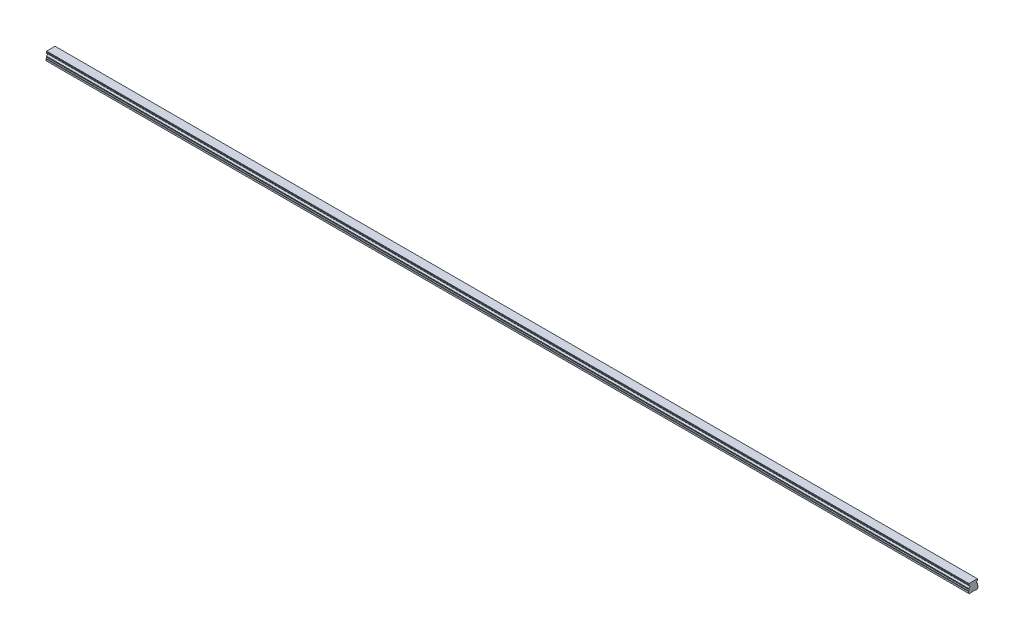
from build123d import *

# Parameters (mm, degrees)
BOSS_EXTRUDE1_DEPTH        = 1440
SKETCH3_R                  = 2.5
SKETCH3_R_2                = 2.1
CUT_EXTRUDE3_DEPTH         = 7
SKETCH3_2_R                = 2.1
CUT_EXTRUDE4_DEPTH         = 9.5
CHAMFER1_SIZE              = 0.4
LPATTERN2_COUNT            = 24
LPATTERN2_PITCH            = 60
CHAMFER1_OF_LPATTERN2_SIZE = 0.4


with BuildPart() as part:
    # Sketch1 → Boss-Extrude1 (new body)
    with BuildSketch(Plane(origin=(0, 0, 0), x_dir=(0, 0, -1), z_dir=(1, 0, 0))):
        with BuildLine():
            Line((6.59, 14), (-6.59, 14))
            Line((-6.59, 14), (-6.59, 13.15))
            Line((-6.59, 13.15), (-6.96, 12.356532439))
            Line((-6.96, 12.356532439), (-6.96, 11.435174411))
            ThreePointArc((-6.96, 11.435174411), (-5.25, 9.5), (-6.96, 7.564825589))
            Line((-6.96, 7.564825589), (-6.96, 6.643467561))
            Line((-6.96, 6.643467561), (-6.59, 5.85))
            Line((-6.59, 5.85), (-7.032116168, 4.2))
            Line((-7.032116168, 4.2), (-7.5, 3.929867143))
            Line((-7.5, 3.929867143), (-7.5, 1.4))
            Line((-7.5, 1.4), (-6.1, 0))
            Line((-6.1, 0), (-3.65, 0))
            Line((-3.65, 0), (-3.25, 0.4))
            Line((-3.25, 0.4), (3.25, 0.4))
            Line((3.25, 0.4), (3.65, 0))
            Line((3.65, 0), (6.1, 0))
            Line((6.1, 0), (7.5, 1.4))
            Line((7.5, 1.4), (7.5, 3.929867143))
            Line((7.5, 3.929867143), (7.032116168, 4.2))
            Line((7.032116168, 4.2), (6.59, 5.85))
            Line((6.59, 5.85), (6.96, 6.643467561))
            Line((6.96, 6.643467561), (6.96, 7.564825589))
            ThreePointArc((6.96, 7.564825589), (5.25, 9.5), (6.96, 11.435174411))
            Line((6.96, 11.435174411), (6.96, 12.356532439))
            Line((6.96, 12.356532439), (6.59, 13.15))
            Line((6.59, 13.15), (6.59, 14))
        make_face()
    extrude(amount=BOSS_EXTRUDE1_DEPTH)

    # Sketch3 → Cut-Extrude3 (cut)
    with BuildSketch(Plane.XZ):
        with Locations(Location((30, 0, 0), (0, 0, 270))):
            Circle(SKETCH3_R)
        with Locations(Location((30, 0, 0), (0, 0, 270))):
            Circle(SKETCH3_R_2, mode=Mode.SUBTRACT)
    cut_extrude3 = extrude(amount=-CUT_EXTRUDE3_DEPTH, mode=Mode.SUBTRACT)

    # Sketch3_2 → Cut-Extrude4 (cut)
    with BuildSketch(Plane.XZ):
        with Locations(Location((30, 0, 0), (0, 0, 270))):
            Circle(SKETCH3_2_R)
    cut_extrude4 = extrude(amount=-CUT_EXTRUDE4_DEPTH, mode=Mode.SUBTRACT)

    # Cut-Extrude5 cone 1 section (on through the dimple's axis) → Cut-Extrude5 (revolve, cut)
    with BuildSketch(Plane(origin=(30, 9.5, 0), x_dir=(0, 0, -1), z_dir=(1, 0, 0))):
        Polygon((0, 0), (2.1, 0), (0, 1.212435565), align=None)
    revolve(axis=Axis((30, 9.5, 0), (0, 1, 0)), mode=Mode.SUBTRACT)

    # Chamfer1
    chamfer1_edges = [part.edges().sort_by_distance(p)[0] for p in [
        (30, 0.4, 2.5),
    ]]
    chamfer(chamfer1_edges, length=CHAMFER1_SIZE)

    # LPattern2: Cut-Extrude3, Cut-Extrude4 ×24
    with Locations(*[(i * LPATTERN2_PITCH, 0, 0) for i in range(1, LPATTERN2_COUNT)]):
        add(cut_extrude3, mode=Mode.SUBTRACT)
        add(cut_extrude4, mode=Mode.SUBTRACT)

    # Chamfer1 of LPattern2
    chamfer1_of_lpattern2_edges = [part.edges().sort_by_distance(p)[0] for p in [
        (90, 0.4, 2.5),
        (150, 0.4, 2.5),
        (210, 0.4, 2.5),
        (270, 0.4, 2.5),
        (330, 0.4, 2.5),
        (390, 0.4, 2.5),
        (450, 0.4, 2.5),
        (510, 0.4, 2.5),
        (570, 0.4, 2.5),
        (630, 0.4, 2.5),
        (690, 0.4, 2.5),
        (750, 0.4, 2.5),
        (810, 0.4, 2.5),
        (870, 0.4, 2.5),
        (930, 0.4, 2.5),
        (990, 0.4, 2.5),
        (1050, 0.4, 2.5),
        (1110, 0.4, 2.5),
        (1170, 0.4, 2.5),
        (1230, 0.4, 2.5),
        (1290, 0.4, 2.5),
        (1350, 0.4, 2.5),
        (1410, 0.4, 2.5),
    ]]
    chamfer(chamfer1_of_lpattern2_edges, length=CHAMFER1_OF_LPATTERN2_SIZE)


solid = part.part
